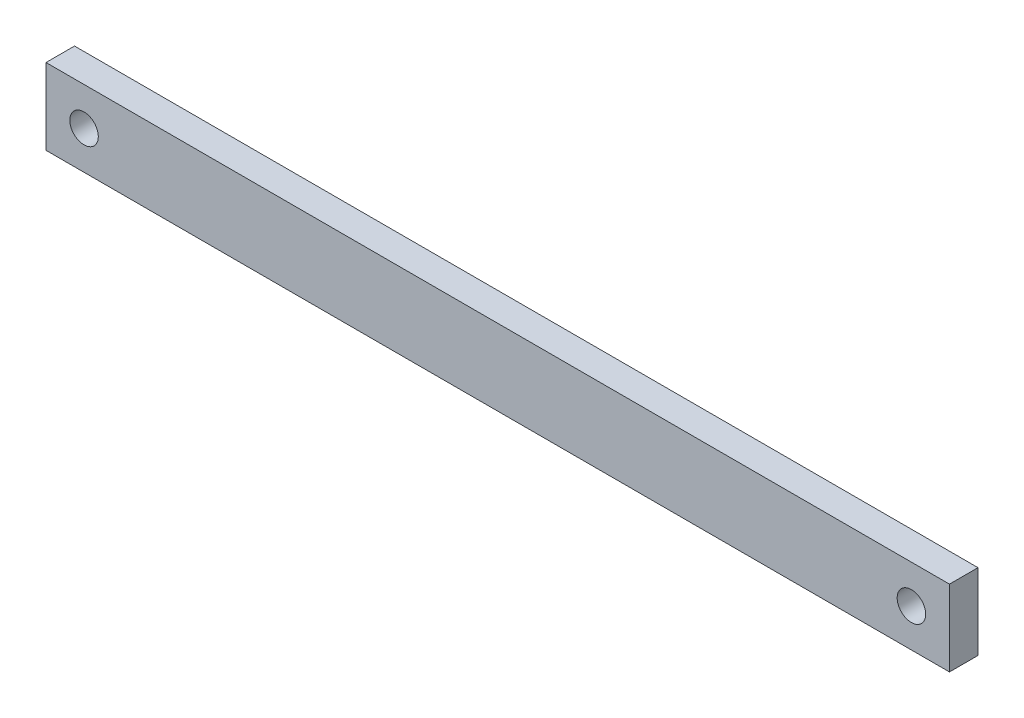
from build123d import *

# Parameters (mm, degrees)
ESQUISSE1_W      = 95
ESQUISSE1_H      = 8
ESQUISSE1_R      = 1.5
EXTRUSION1_DEPTH = 3


with BuildPart() as part:
    # Esquisse1 → Extrusion1 (new body)
    with BuildSketch(Plane.XY):
        with Locations((43.5, 0)):
            Rectangle(ESQUISSE1_W, ESQUISSE1_H)
        Circle(ESQUISSE1_R, mode=Mode.SUBTRACT)
        with Locations((87, 0)):
            Circle(ESQUISSE1_R, mode=Mode.SUBTRACT)
    extrude(amount=EXTRUSION1_DEPTH)


solid = part.part
